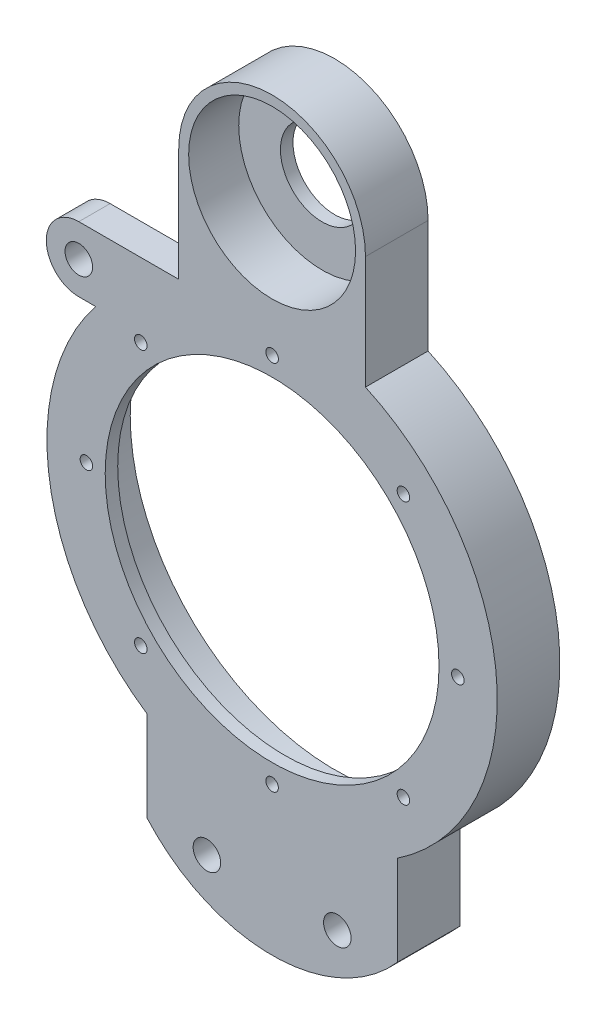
ISO-10303-21;
HEADER;
FILE_DESCRIPTION(('STEP AP214'),'2;1');
FILE_NAME('part.step','',(''),(''),'','','');
FILE_SCHEMA(('AUTOMOTIVE_DESIGN { 1 0 10303 214 1 1 1 1 }'));
ENDSEC;
DATA;
#1=APPLICATION_CONTEXT('core data for automotive mechanical design processes');
#2=APPLICATION_PROTOCOL_DEFINITION('international standard','automotive_design',2000,#1);
#3=PRODUCT_CONTEXT('',#1,'mechanical');
#4=PRODUCT('Part','Part','',(#3));
#5=PRODUCT_RELATED_PRODUCT_CATEGORY('part','',(#4));
#6=PRODUCT_DEFINITION_FORMATION('','',#4);
#7=PRODUCT_DEFINITION_CONTEXT('part definition',#1,'design');
#8=PRODUCT_DEFINITION('design','',#6,#7);
#9=PRODUCT_DEFINITION_SHAPE('','',#8);
#10=(LENGTH_UNIT() NAMED_UNIT(*) SI_UNIT(.MILLI.,.METRE.));
#11=(NAMED_UNIT(*) PLANE_ANGLE_UNIT() SI_UNIT($,.RADIAN.));
#12=(NAMED_UNIT(*) SI_UNIT($,.STERADIAN.) SOLID_ANGLE_UNIT());
#13=UNCERTAINTY_MEASURE_WITH_UNIT(LENGTH_MEASURE(1.E-05),#10,'distance_accuracy_value','');
#14=(GEOMETRIC_REPRESENTATION_CONTEXT(3) GLOBAL_UNCERTAINTY_ASSIGNED_CONTEXT((#13)) GLOBAL_UNIT_ASSIGNED_CONTEXT((#10,
#11,#12)) REPRESENTATION_CONTEXT('',''));
#15=CARTESIAN_POINT('',(0.,0.,0.));
#16=DIRECTION('',(0.,0.,1.));
#17=DIRECTION('',(1.,0.,0.));
#18=AXIS2_PLACEMENT_3D('',#15,#16,#17);
#19=CARTESIAN_POINT('',(30.005594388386,142.651168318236,0.));
#20=DIRECTION('',(0.,0.,-1.));
#21=DIRECTION('',(-1.,0.,0.));
#22=AXIS2_PLACEMENT_3D('',#19,#20,#21);
#23=PLANE('',#22);
#24=CARTESIAN_POINT('',(30.005594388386,142.651168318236,0.));
#25=DIRECTION('',(0.,0.,-1.));
#26=DIRECTION('',(-1.,0.,0.));
#27=AXIS2_PLACEMENT_3D('',#24,#25,#26);
#28=CIRCLE('',#27,10.);
#29=CARTESIAN_POINT('',(20.005594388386,142.651168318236,0.));
#30=VERTEX_POINT('',#29);
#31=EDGE_CURVE('E467',#30,#30,#28,.T.);
#32=ORIENTED_EDGE('',*,*,#31,.F.);
#33=EDGE_LOOP('',(#32));
#34=FACE_BOUND('',#33,.T.);
#35=CARTESIAN_POINT('',(14.380594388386,-0.536865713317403,0.));
#36=DIRECTION('',(0.,0.,1.));
#37=DIRECTION('',(1.,0.,0.));
#38=AXIS2_PLACEMENT_3D('',#35,#36,#37);
#39=CIRCLE('',#38,3.3);
#40=CARTESIAN_POINT('',(17.680594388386,-0.536865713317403,0.));
#41=VERTEX_POINT('',#40);
#42=EDGE_CURVE('E447',#41,#41,#39,.T.);
#43=ORIENTED_EDGE('',*,*,#42,.T.);
#44=EDGE_LOOP('',(#43));
#45=FACE_BOUND('',#44,.T.);
#46=CARTESIAN_POINT('',(45.630594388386,-0.536865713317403,0.));
#47=DIRECTION('',(0.,0.,-1.));
#48=DIRECTION('',(-1.,0.,0.));
#49=AXIS2_PLACEMENT_3D('',#46,#47,#48);
#50=CIRCLE('',#49,3.3);
#51=CARTESIAN_POINT('',(42.330594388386,-0.536865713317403,0.));
#52=VERTEX_POINT('',#51);
#53=EDGE_CURVE('E455',#52,#52,#50,.T.);
#54=ORIENTED_EDGE('',*,*,#53,.F.);
#55=EDGE_LOOP('',(#54));
#56=FACE_BOUND('',#55,.T.);
#57=CARTESIAN_POINT('',(30.005594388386,66.4511683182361,0.));
#58=DIRECTION('',(0.,0.,-1.));
#59=DIRECTION('',(-1.,0.,0.));
#60=AXIS2_PLACEMENT_3D('',#57,#58,#59);
#61=CIRCLE('',#60,49.);
#62=CARTESIAN_POINT('',(-18.994405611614,66.4511683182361,0.));
#63=VERTEX_POINT('',#62);
#64=EDGE_CURVE('E474',#63,#63,#61,.T.);
#65=ORIENTED_EDGE('',*,*,#64,.F.);
#66=EDGE_LOOP('',(#65));
#67=FACE_BOUND('',#66,.T.);
#68=CARTESIAN_POINT('',(30.005594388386,66.4511683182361,0.));
#69=DIRECTION('',(0.,0.,1.));
#70=DIRECTION('',(1.,0.,0.));
#71=AXIS2_PLACEMENT_3D('',#68,#69,#70);
#72=CIRCLE('',#71,53.958270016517);
#73=CARTESIAN_POINT('',(7.63007924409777,115.551384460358,0.));
#74=VERTEX_POINT('',#73);
#75=CARTESIAN_POINT('',(0.,21.6052185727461,0.));
#76=VERTEX_POINT('',#75);
#77=EDGE_CURVE('E351',#74,#76,#72,.T.);
#78=ORIENTED_EDGE('',*,*,#77,.F.);
#79=DIRECTION('',(0.,-1.,0.));
#80=VECTOR('',#79,1.);
#81=CARTESIAN_POINT('',(7.63007924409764,142.651168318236,0.));
#82=LINE('',#81,#80);
#83=CARTESIAN_POINT('',(7.63007924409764,142.651168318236,0.));
#84=VERTEX_POINT('',#83);
#85=EDGE_CURVE('E354',#84,#74,#82,.T.);
#86=ORIENTED_EDGE('',*,*,#85,.F.);
#87=CARTESIAN_POINT('',(30.005594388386,142.651168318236,0.));
#88=DIRECTION('',(0.,0.,-1.));
#89=DIRECTION('',(-1.,0.,0.));
#90=AXIS2_PLACEMENT_3D('',#87,#88,#89);
#91=CIRCLE('',#90,22.3755151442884);
#92=CARTESIAN_POINT('',(52.3811095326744,142.651168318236,0.));
#93=VERTEX_POINT('',#92);
#94=EDGE_CURVE('E329',#84,#93,#91,.T.);
#95=ORIENTED_EDGE('',*,*,#94,.T.);
#96=DIRECTION('',(0.,1.,0.));
#97=VECTOR('',#96,1.);
#98=CARTESIAN_POINT('',(52.3811095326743,115.551384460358,0.));
#99=LINE('',#98,#97);
#100=CARTESIAN_POINT('',(52.3811095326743,115.551384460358,0.));
#101=VERTEX_POINT('',#100);
#102=EDGE_CURVE('E333',#101,#93,#99,.T.);
#103=ORIENTED_EDGE('',*,*,#102,.F.);
#104=CARTESIAN_POINT('',(30.005594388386,66.4511683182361,0.));
#105=DIRECTION('',(0.,0.,1.));
#106=DIRECTION('',(1.,0.,0.));
#107=AXIS2_PLACEMENT_3D('',#104,#105,#106);
#108=CIRCLE('',#107,53.958270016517);
#109=CARTESIAN_POINT('',(60.011188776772,21.6052185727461,0.));
#110=VERTEX_POINT('',#109);
#111=EDGE_CURVE('E338',#110,#101,#108,.T.);
#112=ORIENTED_EDGE('',*,*,#111,.F.);
#113=DIRECTION('',(0.,1.,0.));
#114=VECTOR('',#113,1.);
#115=CARTESIAN_POINT('',(60.011188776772,0.,0.));
#116=LINE('',#115,#114);
#117=CARTESIAN_POINT('',(60.011188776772,0.,0.));
#118=VERTEX_POINT('',#117);
#119=EDGE_CURVE('E341',#118,#110,#116,.T.);
#120=ORIENTED_EDGE('',*,*,#119,.F.);
#121=CARTESIAN_POINT('',(30.005594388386,26.4511683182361,0.));
#122=DIRECTION('',(0.,0.,1.));
#123=DIRECTION('',(1.,0.,0.));
#124=AXIS2_PLACEMENT_3D('',#121,#122,#123);
#125=CIRCLE('',#124,40.);
#126=CARTESIAN_POINT('',(0.,0.,0.));
#127=VERTEX_POINT('',#126);
#128=EDGE_CURVE('E344',#127,#118,#125,.T.);
#129=ORIENTED_EDGE('',*,*,#128,.F.);
#130=DIRECTION('',(0.,1.,0.));
#131=VECTOR('',#130,1.);
#132=CARTESIAN_POINT('',(0.,0.,0.));
#133=LINE('',#132,#131);
#134=EDGE_CURVE('E347',#127,#76,#133,.T.);
#135=ORIENTED_EDGE('',*,*,#134,.T.);
#136=EDGE_LOOP('',(#78,#86,#95,#103,#112,#120,#129,#135));
#137=FACE_BOUND('',#136,.T.);
#138=ADVANCED_FACE('F205',(#34,#45,#56,#67,#137),#23,.T.);
#139=CARTESIAN_POINT('',(7.63007924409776,115.551384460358,15.));
#140=DIRECTION('',(0.,-1.,0.));
#141=DIRECTION('',(0.,0.,-1.));
#142=AXIS2_PLACEMENT_3D('',#139,#140,#141);
#143=PLANE('',#142);
#144=DIRECTION('',(1.,0.,0.));
#145=VECTOR('',#144,1.);
#146=CARTESIAN_POINT('',(30.005594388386,115.551384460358,7.5));
#147=LINE('',#146,#145);
#148=CARTESIAN_POINT('',(-16.3138964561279,115.551384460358,7.5));
#149=VERTEX_POINT('',#148);
#150=CARTESIAN_POINT('',(7.63007924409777,115.551384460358,7.5));
#151=VERTEX_POINT('',#150);
#152=EDGE_CURVE('E309',#149,#151,#147,.T.);
#153=ORIENTED_EDGE('',*,*,#152,.F.);
#154=DIRECTION('',(0.,0.,-1.));
#155=VECTOR('',#154,1.);
#156=CARTESIAN_POINT('',(-16.3138964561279,115.551384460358,15.));
#157=LINE('',#156,#155);
#158=CARTESIAN_POINT('',(-16.3138964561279,115.551384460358,15.));
#159=VERTEX_POINT('',#158);
#160=EDGE_CURVE('E305',#159,#149,#157,.T.);
#161=ORIENTED_EDGE('',*,*,#160,.F.);
#162=DIRECTION('',(-1.,0.,0.));
#163=VECTOR('',#162,1.);
#164=CARTESIAN_POINT('',(7.63007924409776,115.551384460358,15.));
#165=LINE('',#164,#163);
#166=CARTESIAN_POINT('',(7.63007924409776,115.551384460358,15.));
#167=VERTEX_POINT('',#166);
#168=EDGE_CURVE('E290',#167,#159,#165,.T.);
#169=ORIENTED_EDGE('',*,*,#168,.F.);
#170=DIRECTION('',(0.,0.,-1.));
#171=VECTOR('',#170,1.);
#172=CARTESIAN_POINT('',(7.63007924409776,115.551384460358,15.));
#173=LINE('',#172,#171);
#174=EDGE_CURVE('E216',#167,#151,#173,.T.);
#175=ORIENTED_EDGE('',*,*,#174,.T.);
#176=EDGE_LOOP('',(#153,#161,#169,#175));
#177=FACE_BOUND('',#176,.T.);
#178=ADVANCED_FACE('F306',(#177),#143,.F.);
#179=CARTESIAN_POINT('',(-16.3138964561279,107.7542090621,15.));
#180=DIRECTION('',(0.,0.,-1.));
#181=DIRECTION('',(-1.,0.,0.));
#182=AXIS2_PLACEMENT_3D('',#179,#180,#181);
#183=CYLINDRICAL_SURFACE('',#182,7.7971753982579);
#184=CARTESIAN_POINT('',(-16.3138964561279,107.7542090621,7.5));
#185=DIRECTION('',(0.,0.,-1.));
#186=DIRECTION('',(-1.,0.,0.));
#187=AXIS2_PLACEMENT_3D('',#184,#185,#186);
#188=CIRCLE('',#187,7.7971753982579);
#189=CARTESIAN_POINT('',(-16.3138964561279,99.9570336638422,7.5));
#190=VERTEX_POINT('',#189);
#191=EDGE_CURVE('E416',#190,#149,#188,.T.);
#192=ORIENTED_EDGE('',*,*,#191,.F.);
#193=DIRECTION('',(0.,0.,-1.));
#194=VECTOR('',#193,1.);
#195=CARTESIAN_POINT('',(-16.3138964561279,99.9570336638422,15.));
#196=LINE('',#195,#194);
#197=CARTESIAN_POINT('',(-16.3138964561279,99.9570336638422,15.));
#198=VERTEX_POINT('',#197);
#199=EDGE_CURVE('E313',#198,#190,#196,.T.);
#200=ORIENTED_EDGE('',*,*,#199,.F.);
#201=CARTESIAN_POINT('',(-16.3138964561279,107.7542090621,15.));
#202=DIRECTION('',(0.,0.,1.));
#203=DIRECTION('',(1.,0.,0.));
#204=AXIS2_PLACEMENT_3D('',#201,#202,#203);
#205=CIRCLE('',#204,7.7971753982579);
#206=EDGE_CURVE('E295',#159,#198,#205,.T.);
#207=ORIENTED_EDGE('',*,*,#206,.F.);
#208=ORIENTED_EDGE('',*,*,#160,.T.);
#209=EDGE_LOOP('',(#192,#200,#207,#208));
#210=FACE_BOUND('',#209,.T.);
#211=ADVANCED_FACE('F315',(#210),#183,.T.);
#212=CARTESIAN_POINT('',(-16.3138964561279,99.9570336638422,15.));
#213=DIRECTION('',(0.,1.,0.));
#214=DIRECTION('',(0.,0.,1.));
#215=AXIS2_PLACEMENT_3D('',#212,#213,#214);
#216=PLANE('',#215);
#217=DIRECTION('',(-1.,0.,0.));
#218=VECTOR('',#217,1.);
#219=CARTESIAN_POINT('',(30.0055943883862,99.9570336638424,7.5));
#220=LINE('',#219,#218);
#221=CARTESIAN_POINT('',(-12.2892266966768,99.9570336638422,7.5));
#222=VERTEX_POINT('',#221);
#223=EDGE_CURVE('E402',#222,#190,#220,.T.);
#224=ORIENTED_EDGE('',*,*,#223,.F.);
#225=DIRECTION('',(0.,0.,-1.));
#226=VECTOR('',#225,1.);
#227=CARTESIAN_POINT('',(-12.2892266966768,99.9570336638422,15.));
#228=LINE('',#227,#226);
#229=CARTESIAN_POINT('',(-12.2892266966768,99.9570336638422,15.));
#230=VERTEX_POINT('',#229);
#231=EDGE_CURVE('E362',#230,#222,#228,.T.);
#232=ORIENTED_EDGE('',*,*,#231,.F.);
#233=DIRECTION('',(1.,0.,0.));
#234=VECTOR('',#233,1.);
#235=CARTESIAN_POINT('',(-16.3138964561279,99.9570336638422,15.));
#236=LINE('',#235,#234);
#237=EDGE_CURVE('E319',#198,#230,#236,.T.);
#238=ORIENTED_EDGE('',*,*,#237,.F.);
#239=ORIENTED_EDGE('',*,*,#199,.T.);
#240=EDGE_LOOP('',(#224,#232,#238,#239));
#241=FACE_BOUND('',#240,.T.);
#242=ADVANCED_FACE('F413',(#241),#216,.F.);
#243=CARTESIAN_POINT('',(30.005594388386,66.4511683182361,15.));
#244=DIRECTION('',(0.,0.,-1.));
#245=DIRECTION('',(-1.,0.,0.));
#246=AXIS2_PLACEMENT_3D('',#243,#244,#245);
#247=CYLINDRICAL_SURFACE('',#246,40.);
#248=CARTESIAN_POINT('',(30.005594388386,66.4511683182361,15.));
#249=DIRECTION('',(0.,0.,1.));
#250=DIRECTION('',(1.,0.,0.));
#251=AXIS2_PLACEMENT_3D('',#248,#249,#250);
#252=CIRCLE('',#251,40.);
#253=CARTESIAN_POINT('',(70.005594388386,66.4511683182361,15.));
#254=VERTEX_POINT('',#253);
#255=EDGE_CURVE('E442',#254,#254,#252,.T.);
#256=ORIENTED_EDGE('',*,*,#255,.T.);
#257=EDGE_LOOP('',(#256));
#258=FACE_BOUND('',#257,.T.);
#259=CARTESIAN_POINT('',(30.005594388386,66.4511683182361,12.));
#260=DIRECTION('',(0.,0.,-1.));
#261=DIRECTION('',(-1.,0.,0.));
#262=AXIS2_PLACEMENT_3D('',#259,#260,#261);
#263=CIRCLE('',#262,40.);
#264=CARTESIAN_POINT('',(-9.99440561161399,66.4511683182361,12.));
#265=VERTEX_POINT('',#264);
#266=EDGE_CURVE('E209',#265,#265,#263,.T.);
#267=ORIENTED_EDGE('',*,*,#266,.T.);
#268=EDGE_LOOP('',(#267));
#269=FACE_BOUND('',#268,.T.);
#270=ADVANCED_FACE('F624',(#258,#269),#247,.F.);
#271=CARTESIAN_POINT('',(30.005594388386,142.651168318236,15.));
#272=DIRECTION('',(0.,0.,-1.));
#273=DIRECTION('',(-1.,0.,0.));
#274=AXIS2_PLACEMENT_3D('',#271,#272,#273);
#275=CYLINDRICAL_SURFACE('',#274,20.);
#276=CARTESIAN_POINT('',(30.005594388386,142.651168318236,15.));
#277=DIRECTION('',(0.,0.,1.));
#278=DIRECTION('',(1.,0.,0.));
#279=AXIS2_PLACEMENT_3D('',#276,#277,#278);
#280=CIRCLE('',#279,20.);
#281=CARTESIAN_POINT('',(50.005594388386,142.651168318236,15.));
#282=VERTEX_POINT('',#281);
#283=EDGE_CURVE('E334',#282,#282,#280,.T.);
#284=ORIENTED_EDGE('',*,*,#283,.T.);
#285=EDGE_LOOP('',(#284));
#286=FACE_BOUND('',#285,.T.);
#287=CARTESIAN_POINT('',(30.005594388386,142.651168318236,3.));
#288=DIRECTION('',(0.,0.,-1.));
#289=DIRECTION('',(-1.,0.,0.));
#290=AXIS2_PLACEMENT_3D('',#287,#288,#289);
#291=CIRCLE('',#290,20.);
#292=CARTESIAN_POINT('',(10.005594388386,142.651168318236,3.));
#293=VERTEX_POINT('',#292);
#294=EDGE_CURVE('E459',#293,#293,#291,.T.);
#295=ORIENTED_EDGE('',*,*,#294,.T.);
#296=EDGE_LOOP('',(#295));
#297=FACE_BOUND('',#296,.T.);
#298=ADVANCED_FACE('F565',(#286,#297),#275,.F.);
#299=CARTESIAN_POINT('',(30.005594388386,142.651168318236,15.));
#300=DIRECTION('',(0.,0.,-1.));
#301=DIRECTION('',(-1.,0.,0.));
#302=AXIS2_PLACEMENT_3D('',#299,#300,#301);
#303=PLANE('',#302);
#304=CARTESIAN_POINT('',(-16.3138964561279,107.7542090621,15.));
#305=DIRECTION('',(0.,0.,1.));
#306=DIRECTION('',(1.,0.,0.));
#307=AXIS2_PLACEMENT_3D('',#304,#305,#306);
#308=CIRCLE('',#307,3.3);
#309=CARTESIAN_POINT('',(-13.0138964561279,107.7542090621,15.));
#310=VERTEX_POINT('',#309);
#311=EDGE_CURVE('E555',#310,#310,#308,.T.);
#312=ORIENTED_EDGE('',*,*,#311,.F.);
#313=EDGE_LOOP('',(#312));
#314=FACE_BOUND('',#313,.T.);
#315=CARTESIAN_POINT('',(30.005594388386,110.951168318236,15.));
#316=DIRECTION('',(0.,0.,-1.));
#317=DIRECTION('',(-1.,0.,0.));
#318=AXIS2_PLACEMENT_3D('',#315,#316,#317);
#319=CIRCLE('',#318,1.5);
#320=CARTESIAN_POINT('',(28.505594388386,110.951168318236,15.));
#321=VERTEX_POINT('',#320);
#322=EDGE_CURVE('E516',#321,#321,#319,.T.);
#323=ORIENTED_EDGE('',*,*,#322,.T.);
#324=EDGE_LOOP('',(#323));
#325=FACE_BOUND('',#324,.T.);
#326=CARTESIAN_POINT('',(-1.46065737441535,97.9174200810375,15.));
#327=DIRECTION('',(0.,0.,-1.));
#328=DIRECTION('',(-1.,0.,0.));
#329=AXIS2_PLACEMENT_3D('',#326,#327,#328);
#330=CIRCLE('',#329,1.50000000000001);
#331=CARTESIAN_POINT('',(-2.96065737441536,97.9174200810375,15.));
#332=VERTEX_POINT('',#331);
#333=EDGE_CURVE('E508',#332,#332,#330,.T.);
#334=ORIENTED_EDGE('',*,*,#333,.T.);
#335=EDGE_LOOP('',(#334));
#336=FACE_BOUND('',#335,.T.);
#337=CARTESIAN_POINT('',(-14.494405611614,66.4511683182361,15.));
#338=DIRECTION('',(0.,0.,-1.));
#339=DIRECTION('',(-1.,0.,0.));
#340=AXIS2_PLACEMENT_3D('',#337,#338,#339);
#341=CIRCLE('',#340,1.5);
#342=CARTESIAN_POINT('',(-15.994405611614,66.4511683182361,15.));
#343=VERTEX_POINT('',#342);
#344=EDGE_CURVE('E500',#343,#343,#341,.T.);
#345=ORIENTED_EDGE('',*,*,#344,.T.);
#346=EDGE_LOOP('',(#345));
#347=FACE_BOUND('',#346,.T.);
#348=CARTESIAN_POINT('',(-1.46065737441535,34.9849165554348,15.));
#349=DIRECTION('',(0.,0.,-1.));
#350=DIRECTION('',(-1.,0.,0.));
#351=AXIS2_PLACEMENT_3D('',#348,#349,#350);
#352=CIRCLE('',#351,1.5);
#353=CARTESIAN_POINT('',(-2.96065737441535,34.9849165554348,15.));
#354=VERTEX_POINT('',#353);
#355=EDGE_CURVE('E491',#354,#354,#352,.T.);
#356=ORIENTED_EDGE('',*,*,#355,.T.);
#357=EDGE_LOOP('',(#356));
#358=FACE_BOUND('',#357,.T.);
#359=CARTESIAN_POINT('',(30.005594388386,21.9511683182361,15.));
#360=DIRECTION('',(0.,0.,-1.));
#361=DIRECTION('',(-1.,0.,0.));
#362=AXIS2_PLACEMENT_3D('',#359,#360,#361);
#363=CIRCLE('',#362,1.5);
#364=CARTESIAN_POINT('',(28.505594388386,21.9511683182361,15.));
#365=VERTEX_POINT('',#364);
#366=EDGE_CURVE('E539',#365,#365,#363,.T.);
#367=ORIENTED_EDGE('',*,*,#366,.T.);
#368=EDGE_LOOP('',(#367));
#369=FACE_BOUND('',#368,.T.);
#370=CARTESIAN_POINT('',(61.4718461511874,34.9849165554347,15.));
#371=DIRECTION('',(0.,0.,-1.));
#372=DIRECTION('',(-1.,0.,0.));
#373=AXIS2_PLACEMENT_3D('',#370,#371,#372);
#374=CIRCLE('',#373,1.5);
#375=CARTESIAN_POINT('',(59.9718461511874,34.9849165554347,15.));
#376=VERTEX_POINT('',#375);
#377=EDGE_CURVE('E531',#376,#376,#374,.T.);
#378=ORIENTED_EDGE('',*,*,#377,.T.);
#379=EDGE_LOOP('',(#378));
#380=FACE_BOUND('',#379,.T.);
#381=CARTESIAN_POINT('',(74.505594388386,66.4511683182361,15.));
#382=DIRECTION('',(0.,0.,-1.));
#383=DIRECTION('',(-1.,0.,0.));
#384=AXIS2_PLACEMENT_3D('',#381,#382,#383);
#385=CIRCLE('',#384,1.5);
#386=CARTESIAN_POINT('',(73.005594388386,66.4511683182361,15.));
#387=VERTEX_POINT('',#386);
#388=EDGE_CURVE('E523',#387,#387,#385,.T.);
#389=ORIENTED_EDGE('',*,*,#388,.T.);
#390=EDGE_LOOP('',(#389));
#391=FACE_BOUND('',#390,.T.);
#392=CARTESIAN_POINT('',(61.4718461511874,97.9174200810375,15.));
#393=DIRECTION('',(0.,0.,-1.));
#394=DIRECTION('',(-1.,0.,0.));
#395=AXIS2_PLACEMENT_3D('',#392,#393,#394);
#396=CIRCLE('',#395,1.50000000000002);
#397=CARTESIAN_POINT('',(59.9718461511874,97.9174200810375,15.));
#398=VERTEX_POINT('',#397);
#399=EDGE_CURVE('E479',#398,#398,#396,.T.);
#400=ORIENTED_EDGE('',*,*,#399,.T.);
#401=EDGE_LOOP('',(#400));
#402=FACE_BOUND('',#401,.T.);
#403=CARTESIAN_POINT('',(45.630594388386,-0.536865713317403,15.));
#404=DIRECTION('',(0.,0.,-1.));
#405=DIRECTION('',(-1.,0.,0.));
#406=AXIS2_PLACEMENT_3D('',#403,#404,#405);
#407=CIRCLE('',#406,3.3);
#408=CARTESIAN_POINT('',(42.330594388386,-0.536865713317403,15.));
#409=VERTEX_POINT('',#408);
#410=EDGE_CURVE('E451',#409,#409,#407,.T.);
#411=ORIENTED_EDGE('',*,*,#410,.T.);
#412=EDGE_LOOP('',(#411));
#413=FACE_BOUND('',#412,.T.);
#414=CARTESIAN_POINT('',(30.005594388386,142.651168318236,15.));
#415=DIRECTION('',(0.,0.,-1.));
#416=DIRECTION('',(-1.,0.,0.));
#417=AXIS2_PLACEMENT_3D('',#414,#415,#416);
#418=CIRCLE('',#417,22.3755151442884);
#419=CARTESIAN_POINT('',(7.63007924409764,142.651168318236,15.));
#420=VERTEX_POINT('',#419);
#421=CARTESIAN_POINT('',(52.3811095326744,142.651168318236,15.));
#422=VERTEX_POINT('',#421);
#423=EDGE_CURVE('E356',#420,#422,#418,.T.);
#424=ORIENTED_EDGE('',*,*,#423,.F.);
#425=DIRECTION('',(0.,-1.,0.));
#426=VECTOR('',#425,1.);
#427=CARTESIAN_POINT('',(7.63007924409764,142.651168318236,15.));
#428=LINE('',#427,#426);
#429=EDGE_CURVE('E297',#420,#167,#428,.T.);
#430=ORIENTED_EDGE('',*,*,#429,.T.);
#431=ORIENTED_EDGE('',*,*,#168,.T.);
#432=ORIENTED_EDGE('',*,*,#206,.T.);
#433=ORIENTED_EDGE('',*,*,#237,.T.);
#434=CARTESIAN_POINT('',(30.005594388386,66.4511683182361,15.));
#435=DIRECTION('',(0.,0.,1.));
#436=DIRECTION('',(1.,0.,0.));
#437=AXIS2_PLACEMENT_3D('',#434,#435,#436);
#438=CIRCLE('',#437,53.958270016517);
#439=CARTESIAN_POINT('',(0.,21.6052185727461,15.));
#440=VERTEX_POINT('',#439);
#441=EDGE_CURVE('E322',#230,#440,#438,.T.);
#442=ORIENTED_EDGE('',*,*,#441,.T.);
#443=DIRECTION('',(0.,1.,0.));
#444=VECTOR('',#443,1.);
#445=CARTESIAN_POINT('',(0.,0.,15.));
#446=LINE('',#445,#444);
#447=CARTESIAN_POINT('',(0.,0.,15.));
#448=VERTEX_POINT('',#447);
#449=EDGE_CURVE('E422',#448,#440,#446,.T.);
#450=ORIENTED_EDGE('',*,*,#449,.F.);
#451=CARTESIAN_POINT('',(30.005594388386,26.4511683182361,15.));
#452=DIRECTION('',(0.,0.,1.));
#453=DIRECTION('',(1.,0.,0.));
#454=AXIS2_PLACEMENT_3D('',#451,#452,#453);
#455=CIRCLE('',#454,40.);
#456=CARTESIAN_POINT('',(60.011188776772,0.,15.));
#457=VERTEX_POINT('',#456);
#458=EDGE_CURVE('E424',#448,#457,#455,.T.);
#459=ORIENTED_EDGE('',*,*,#458,.T.);
#460=DIRECTION('',(0.,1.,0.));
#461=VECTOR('',#460,1.);
#462=CARTESIAN_POINT('',(60.011188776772,0.,15.));
#463=LINE('',#462,#461);
#464=CARTESIAN_POINT('',(60.011188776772,21.6052185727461,15.));
#465=VERTEX_POINT('',#464);
#466=EDGE_CURVE('E429',#457,#465,#463,.T.);
#467=ORIENTED_EDGE('',*,*,#466,.T.);
#468=CARTESIAN_POINT('',(30.005594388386,66.4511683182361,15.));
#469=DIRECTION('',(0.,0.,1.));
#470=DIRECTION('',(1.,0.,0.));
#471=AXIS2_PLACEMENT_3D('',#468,#469,#470);
#472=CIRCLE('',#471,53.958270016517);
#473=CARTESIAN_POINT('',(52.3811095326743,115.551384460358,15.));
#474=VERTEX_POINT('',#473);
#475=EDGE_CURVE('E432',#465,#474,#472,.T.);
#476=ORIENTED_EDGE('',*,*,#475,.T.);
#477=DIRECTION('',(0.,1.,0.));
#478=VECTOR('',#477,1.);
#479=CARTESIAN_POINT('',(52.3811095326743,115.551384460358,15.));
#480=LINE('',#479,#478);
#481=EDGE_CURVE('E264',#474,#422,#480,.T.);
#482=ORIENTED_EDGE('',*,*,#481,.T.);
#483=EDGE_LOOP('',(#424,#430,#431,#432,#433,#442,#450,#459,#467,#476,#482));
#484=FACE_BOUND('',#483,.T.);
#485=ORIENTED_EDGE('',*,*,#283,.F.);
#486=EDGE_LOOP('',(#485));
#487=FACE_BOUND('',#486,.T.);
#488=ORIENTED_EDGE('',*,*,#255,.F.);
#489=EDGE_LOOP('',(#488));
#490=FACE_BOUND('',#489,.T.);
#491=CARTESIAN_POINT('',(14.380594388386,-0.536865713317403,15.));
#492=DIRECTION('',(0.,0.,1.));
#493=DIRECTION('',(1.,0.,0.));
#494=AXIS2_PLACEMENT_3D('',#491,#492,#493);
#495=CIRCLE('',#494,3.3);
#496=CARTESIAN_POINT('',(17.680594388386,-0.536865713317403,15.));
#497=VERTEX_POINT('',#496);
#498=EDGE_CURVE('E446',#497,#497,#495,.T.);
#499=ORIENTED_EDGE('',*,*,#498,.F.);
#500=EDGE_LOOP('',(#499));
#501=FACE_BOUND('',#500,.T.);
#502=ADVANCED_FACE('F292',(#314,#325,#336,#347,#358,#369,#380,#391,#402,#413,#484,#487,#490,
#501),#303,.F.);
#503=CARTESIAN_POINT('',(30.005594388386,142.651168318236,15.));
#504=DIRECTION('',(0.,0.,-1.));
#505=DIRECTION('',(-1.,0.,0.));
#506=AXIS2_PLACEMENT_3D('',#503,#504,#505);
#507=CYLINDRICAL_SURFACE('',#506,22.3755151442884);
#508=ORIENTED_EDGE('',*,*,#94,.F.);
#509=DIRECTION('',(0.,0.,-1.));
#510=VECTOR('',#509,1.);
#511=CARTESIAN_POINT('',(7.63007924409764,142.651168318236,15.));
#512=LINE('',#511,#510);
#513=EDGE_CURVE('E14',#420,#84,#512,.T.);
#514=ORIENTED_EDGE('',*,*,#513,.F.);
#515=ORIENTED_EDGE('',*,*,#423,.T.);
#516=DIRECTION('',(0.,0.,-1.));
#517=VECTOR('',#516,1.);
#518=CARTESIAN_POINT('',(52.3811095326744,142.651168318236,15.));
#519=LINE('',#518,#517);
#520=EDGE_CURVE('E328',#422,#93,#519,.T.);
#521=ORIENTED_EDGE('',*,*,#520,.T.);
#522=EDGE_LOOP('',(#508,#514,#515,#521));
#523=FACE_BOUND('',#522,.T.);
#524=ADVANCED_FACE('F207',(#523),#507,.T.);
#525=CARTESIAN_POINT('',(7.63007924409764,142.651168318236,15.));
#526=DIRECTION('',(1.,0.,0.));
#527=DIRECTION('',(0.,1.,0.));
#528=AXIS2_PLACEMENT_3D('',#525,#526,#527);
#529=PLANE('',#528);
#530=ORIENTED_EDGE('',*,*,#85,.T.);
#531=DIRECTION('',(0.,0.,-1.));
#532=VECTOR('',#531,1.);
#533=CARTESIAN_POINT('',(7.63007924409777,115.551384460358,7.5));
#534=LINE('',#533,#532);
#535=EDGE_CURVE('E394',#151,#74,#534,.T.);
#536=ORIENTED_EDGE('',*,*,#535,.F.);
#537=ORIENTED_EDGE('',*,*,#174,.F.);
#538=ORIENTED_EDGE('',*,*,#429,.F.);
#539=ORIENTED_EDGE('',*,*,#513,.T.);
#540=EDGE_LOOP('',(#530,#536,#537,#538,#539));
#541=FACE_BOUND('',#540,.T.);
#542=ADVANCED_FACE('F392',(#541),#529,.F.);
#543=CARTESIAN_POINT('',(30.005594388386,66.4511683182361,15.));
#544=DIRECTION('',(0.,0.,-1.));
#545=DIRECTION('',(-1.,0.,0.));
#546=AXIS2_PLACEMENT_3D('',#543,#544,#545);
#547=CYLINDRICAL_SURFACE('',#546,53.958270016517);
#548=ORIENTED_EDGE('',*,*,#77,.T.);
#549=DIRECTION('',(0.,0.,-1.));
#550=VECTOR('',#549,1.);
#551=CARTESIAN_POINT('',(0.,21.6052185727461,15.));
#552=LINE('',#551,#550);
#553=EDGE_CURVE('E251',#440,#76,#552,.T.);
#554=ORIENTED_EDGE('',*,*,#553,.F.);
#555=ORIENTED_EDGE('',*,*,#441,.F.);
#556=ORIENTED_EDGE('',*,*,#231,.T.);
#557=CARTESIAN_POINT('',(30.005594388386,66.4511683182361,7.5));
#558=DIRECTION('',(0.,0.,-1.));
#559=DIRECTION('',(-1.,0.,0.));
#560=AXIS2_PLACEMENT_3D('',#557,#558,#559);
#561=CIRCLE('',#560,53.958270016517);
#562=EDGE_CURVE('E406',#222,#151,#561,.T.);
#563=ORIENTED_EDGE('',*,*,#562,.T.);
#564=ORIENTED_EDGE('',*,*,#535,.T.);
#565=EDGE_LOOP('',(#548,#554,#555,#556,#563,#564));
#566=FACE_BOUND('',#565,.T.);
#567=ADVANCED_FACE('F419',(#566),#547,.T.);
#568=CARTESIAN_POINT('',(0.,0.,15.));
#569=DIRECTION('',(-1.,0.,0.));
#570=DIRECTION('',(0.,-1.,0.));
#571=AXIS2_PLACEMENT_3D('',#568,#569,#570);
#572=PLANE('',#571);
#573=ORIENTED_EDGE('',*,*,#134,.F.);
#574=DIRECTION('',(0.,0.,-1.));
#575=VECTOR('',#574,1.);
#576=CARTESIAN_POINT('',(0.,0.,15.));
#577=LINE('',#576,#575);
#578=EDGE_CURVE('E368',#448,#127,#577,.T.);
#579=ORIENTED_EDGE('',*,*,#578,.F.);
#580=ORIENTED_EDGE('',*,*,#449,.T.);
#581=ORIENTED_EDGE('',*,*,#553,.T.);
#582=EDGE_LOOP('',(#573,#579,#580,#581));
#583=FACE_BOUND('',#582,.T.);
#584=ADVANCED_FACE('F640',(#583),#572,.T.);
#585=CARTESIAN_POINT('',(30.005594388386,26.4511683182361,15.));
#586=DIRECTION('',(0.,0.,-1.));
#587=DIRECTION('',(-1.,0.,0.));
#588=AXIS2_PLACEMENT_3D('',#585,#586,#587);
#589=CYLINDRICAL_SURFACE('',#588,40.);
#590=ORIENTED_EDGE('',*,*,#128,.T.);
#591=DIRECTION('',(0.,0.,-1.));
#592=VECTOR('',#591,1.);
#593=CARTESIAN_POINT('',(60.011188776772,0.,15.));
#594=LINE('',#593,#592);
#595=EDGE_CURVE('E371',#457,#118,#594,.T.);
#596=ORIENTED_EDGE('',*,*,#595,.F.);
#597=ORIENTED_EDGE('',*,*,#458,.F.);
#598=ORIENTED_EDGE('',*,*,#578,.T.);
#599=EDGE_LOOP('',(#590,#596,#597,#598));
#600=FACE_BOUND('',#599,.T.);
#601=ADVANCED_FACE('F643',(#600),#589,.T.);
#602=CARTESIAN_POINT('',(60.011188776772,0.,15.));
#603=DIRECTION('',(-1.,0.,0.));
#604=DIRECTION('',(0.,0.,1.));
#605=AXIS2_PLACEMENT_3D('',#602,#603,#604);
#606=PLANE('',#605);
#607=ORIENTED_EDGE('',*,*,#119,.T.);
#608=DIRECTION('',(0.,0.,-1.));
#609=VECTOR('',#608,1.);
#610=CARTESIAN_POINT('',(60.011188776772,21.6052185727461,15.));
#611=LINE('',#610,#609);
#612=EDGE_CURVE('E375',#465,#110,#611,.T.);
#613=ORIENTED_EDGE('',*,*,#612,.F.);
#614=ORIENTED_EDGE('',*,*,#466,.F.);
#615=ORIENTED_EDGE('',*,*,#595,.T.);
#616=EDGE_LOOP('',(#607,#613,#614,#615));
#617=FACE_BOUND('',#616,.T.);
#618=ADVANCED_FACE('F646',(#617),#606,.F.);
#619=CARTESIAN_POINT('',(30.005594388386,66.4511683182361,15.));
#620=DIRECTION('',(0.,0.,-1.));
#621=DIRECTION('',(-1.,0.,0.));
#622=AXIS2_PLACEMENT_3D('',#619,#620,#621);
#623=CYLINDRICAL_SURFACE('',#622,53.958270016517);
#624=ORIENTED_EDGE('',*,*,#111,.T.);
#625=DIRECTION('',(0.,0.,-1.));
#626=VECTOR('',#625,1.);
#627=CARTESIAN_POINT('',(52.3811095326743,115.551384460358,15.));
#628=LINE('',#627,#626);
#629=EDGE_CURVE('E379',#474,#101,#628,.T.);
#630=ORIENTED_EDGE('',*,*,#629,.F.);
#631=ORIENTED_EDGE('',*,*,#475,.F.);
#632=ORIENTED_EDGE('',*,*,#612,.T.);
#633=EDGE_LOOP('',(#624,#630,#631,#632));
#634=FACE_BOUND('',#633,.T.);
#635=ADVANCED_FACE('F650',(#634),#623,.T.);
#636=CARTESIAN_POINT('',(52.3811095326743,115.551384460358,15.));
#637=DIRECTION('',(-1.,0.,0.));
#638=DIRECTION('',(0.,-1.,0.));
#639=AXIS2_PLACEMENT_3D('',#636,#637,#638);
#640=PLANE('',#639);
#641=ORIENTED_EDGE('',*,*,#102,.T.);
#642=ORIENTED_EDGE('',*,*,#520,.F.);
#643=ORIENTED_EDGE('',*,*,#481,.F.);
#644=ORIENTED_EDGE('',*,*,#629,.T.);
#645=EDGE_LOOP('',(#641,#642,#643,#644));
#646=FACE_BOUND('',#645,.T.);
#647=ADVANCED_FACE('F385',(#646),#640,.F.);
#648=CARTESIAN_POINT('',(14.380594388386,-0.536865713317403,15.));
#649=DIRECTION('',(0.,0.,-1.));
#650=DIRECTION('',(-1.,0.,0.));
#651=AXIS2_PLACEMENT_3D('',#648,#649,#650);
#652=CYLINDRICAL_SURFACE('',#651,3.3);
#653=ORIENTED_EDGE('',*,*,#498,.T.);
#654=EDGE_LOOP('',(#653));
#655=FACE_BOUND('',#654,.T.);
#656=ORIENTED_EDGE('',*,*,#42,.F.);
#657=EDGE_LOOP('',(#656));
#658=FACE_BOUND('',#657,.T.);
#659=ADVANCED_FACE('F589',(#655,#658),#652,.F.);
#660=CARTESIAN_POINT('',(45.630594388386,-0.536865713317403,15.));
#661=DIRECTION('',(0.,0.,-1.));
#662=DIRECTION('',(-1.,0.,0.));
#663=AXIS2_PLACEMENT_3D('',#660,#661,#662);
#664=CYLINDRICAL_SURFACE('',#663,3.3);
#665=ORIENTED_EDGE('',*,*,#410,.F.);
#666=EDGE_LOOP('',(#665));
#667=FACE_BOUND('',#666,.T.);
#668=ORIENTED_EDGE('',*,*,#53,.T.);
#669=EDGE_LOOP('',(#668));
#670=FACE_BOUND('',#669,.T.);
#671=ADVANCED_FACE('F585',(#667,#670),#664,.F.);
#672=CARTESIAN_POINT('',(30.005594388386,142.651168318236,3.));
#673=DIRECTION('',(0.,0.,-1.));
#674=DIRECTION('',(-1.,0.,0.));
#675=AXIS2_PLACEMENT_3D('',#672,#673,#674);
#676=PLANE('',#675);
#677=CARTESIAN_POINT('',(30.005594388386,142.651168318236,3.));
#678=DIRECTION('',(0.,0.,-1.));
#679=DIRECTION('',(-1.,0.,0.));
#680=AXIS2_PLACEMENT_3D('',#677,#678,#679);
#681=CIRCLE('',#680,10.);
#682=CARTESIAN_POINT('',(20.005594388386,142.651168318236,3.));
#683=VERTEX_POINT('',#682);
#684=EDGE_CURVE('E466',#683,#683,#681,.T.);
#685=ORIENTED_EDGE('',*,*,#684,.T.);
#686=EDGE_LOOP('',(#685));
#687=FACE_BOUND('',#686,.T.);
#688=ORIENTED_EDGE('',*,*,#294,.F.);
#689=EDGE_LOOP('',(#688));
#690=FACE_BOUND('',#689,.T.);
#691=ADVANCED_FACE('F588',(#687,#690),#676,.F.);
#692=CARTESIAN_POINT('',(30.005594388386,142.651168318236,3.));
#693=DIRECTION('',(0.,0.,-1.));
#694=DIRECTION('',(-1.,0.,0.));
#695=AXIS2_PLACEMENT_3D('',#692,#693,#694);
#696=CYLINDRICAL_SURFACE('',#695,10.);
#697=ORIENTED_EDGE('',*,*,#684,.F.);
#698=EDGE_LOOP('',(#697));
#699=FACE_BOUND('',#698,.T.);
#700=ORIENTED_EDGE('',*,*,#31,.T.);
#701=EDGE_LOOP('',(#700));
#702=FACE_BOUND('',#701,.T.);
#703=ADVANCED_FACE('F602',(#699,#702),#696,.F.);
#704=CARTESIAN_POINT('',(30.005594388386,66.4511683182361,12.));
#705=DIRECTION('',(0.,0.,-1.));
#706=DIRECTION('',(-1.,0.,0.));
#707=AXIS2_PLACEMENT_3D('',#704,#705,#706);
#708=CYLINDRICAL_SURFACE('',#707,49.);
#709=CARTESIAN_POINT('',(30.005594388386,66.4511683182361,12.));
#710=DIRECTION('',(0.,0.,-1.));
#711=DIRECTION('',(-1.,0.,0.));
#712=AXIS2_PLACEMENT_3D('',#709,#710,#711);
#713=CIRCLE('',#712,49.);
#714=CARTESIAN_POINT('',(-18.994405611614,66.4511683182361,12.));
#715=VERTEX_POINT('',#714);
#716=EDGE_CURVE('E478',#715,#715,#713,.T.);
#717=ORIENTED_EDGE('',*,*,#716,.F.);
#718=EDGE_LOOP('',(#717));
#719=FACE_BOUND('',#718,.T.);
#720=ORIENTED_EDGE('',*,*,#64,.T.);
#721=EDGE_LOOP('',(#720));
#722=FACE_BOUND('',#721,.T.);
#723=ADVANCED_FACE('F599',(#719,#722),#708,.F.);
#724=CARTESIAN_POINT('',(30.005594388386,66.4511683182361,12.));
#725=DIRECTION('',(0.,0.,-1.));
#726=DIRECTION('',(-1.,0.,0.));
#727=AXIS2_PLACEMENT_3D('',#724,#725,#726);
#728=PLANE('',#727);
#729=CARTESIAN_POINT('',(30.005594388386,110.951168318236,12.));
#730=DIRECTION('',(0.,0.,-1.));
#731=DIRECTION('',(-1.,0.,0.));
#732=AXIS2_PLACEMENT_3D('',#729,#730,#731);
#733=CIRCLE('',#732,1.5);
#734=CARTESIAN_POINT('',(28.505594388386,110.951168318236,12.));
#735=VERTEX_POINT('',#734);
#736=EDGE_CURVE('E487',#735,#735,#733,.T.);
#737=ORIENTED_EDGE('',*,*,#736,.F.);
#738=EDGE_LOOP('',(#737));
#739=FACE_BOUND('',#738,.T.);
#740=CARTESIAN_POINT('',(-1.46065737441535,97.9174200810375,12.));
#741=DIRECTION('',(0.,0.,-1.));
#742=DIRECTION('',(-1.,0.,0.));
#743=AXIS2_PLACEMENT_3D('',#740,#741,#742);
#744=CIRCLE('',#743,1.50000000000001);
#745=CARTESIAN_POINT('',(-2.96065737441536,97.9174200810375,12.));
#746=VERTEX_POINT('',#745);
#747=EDGE_CURVE('E512',#746,#746,#744,.T.);
#748=ORIENTED_EDGE('',*,*,#747,.F.);
#749=EDGE_LOOP('',(#748));
#750=FACE_BOUND('',#749,.T.);
#751=CARTESIAN_POINT('',(-14.494405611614,66.4511683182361,12.));
#752=DIRECTION('',(0.,0.,-1.));
#753=DIRECTION('',(-1.,0.,0.));
#754=AXIS2_PLACEMENT_3D('',#751,#752,#753);
#755=CIRCLE('',#754,1.5);
#756=CARTESIAN_POINT('',(-15.994405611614,66.4511683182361,12.));
#757=VERTEX_POINT('',#756);
#758=EDGE_CURVE('E504',#757,#757,#755,.T.);
#759=ORIENTED_EDGE('',*,*,#758,.F.);
#760=EDGE_LOOP('',(#759));
#761=FACE_BOUND('',#760,.T.);
#762=CARTESIAN_POINT('',(-1.46065737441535,34.9849165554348,12.));
#763=DIRECTION('',(0.,0.,-1.));
#764=DIRECTION('',(-1.,0.,0.));
#765=AXIS2_PLACEMENT_3D('',#762,#763,#764);
#766=CIRCLE('',#765,1.5);
#767=CARTESIAN_POINT('',(-2.96065737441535,34.9849165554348,12.));
#768=VERTEX_POINT('',#767);
#769=EDGE_CURVE('E495',#768,#768,#766,.T.);
#770=ORIENTED_EDGE('',*,*,#769,.F.);
#771=EDGE_LOOP('',(#770));
#772=FACE_BOUND('',#771,.T.);
#773=CARTESIAN_POINT('',(30.005594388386,21.9511683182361,12.));
#774=DIRECTION('',(0.,0.,-1.));
#775=DIRECTION('',(-1.,0.,0.));
#776=AXIS2_PLACEMENT_3D('',#773,#774,#775);
#777=CIRCLE('',#776,1.5);
#778=CARTESIAN_POINT('',(28.505594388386,21.9511683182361,12.));
#779=VERTEX_POINT('',#778);
#780=EDGE_CURVE('E496',#779,#779,#777,.T.);
#781=ORIENTED_EDGE('',*,*,#780,.F.);
#782=EDGE_LOOP('',(#781));
#783=FACE_BOUND('',#782,.T.);
#784=CARTESIAN_POINT('',(61.4718461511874,34.9849165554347,12.));
#785=DIRECTION('',(0.,0.,-1.));
#786=DIRECTION('',(-1.,0.,0.));
#787=AXIS2_PLACEMENT_3D('',#784,#785,#786);
#788=CIRCLE('',#787,1.5);
#789=CARTESIAN_POINT('',(59.9718461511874,34.9849165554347,12.));
#790=VERTEX_POINT('',#789);
#791=EDGE_CURVE('E535',#790,#790,#788,.T.);
#792=ORIENTED_EDGE('',*,*,#791,.F.);
#793=EDGE_LOOP('',(#792));
#794=FACE_BOUND('',#793,.T.);
#795=CARTESIAN_POINT('',(74.505594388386,66.4511683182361,12.));
#796=DIRECTION('',(0.,0.,-1.));
#797=DIRECTION('',(-1.,0.,0.));
#798=AXIS2_PLACEMENT_3D('',#795,#796,#797);
#799=CIRCLE('',#798,1.5);
#800=CARTESIAN_POINT('',(73.005594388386,66.4511683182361,12.));
#801=VERTEX_POINT('',#800);
#802=EDGE_CURVE('E527',#801,#801,#799,.T.);
#803=ORIENTED_EDGE('',*,*,#802,.F.);
#804=EDGE_LOOP('',(#803));
#805=FACE_BOUND('',#804,.T.);
#806=CARTESIAN_POINT('',(61.4718461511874,97.9174200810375,12.));
#807=DIRECTION('',(0.,0.,-1.));
#808=DIRECTION('',(-1.,0.,0.));
#809=AXIS2_PLACEMENT_3D('',#806,#807,#808);
#810=CIRCLE('',#809,1.50000000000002);
#811=CARTESIAN_POINT('',(59.9718461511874,97.9174200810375,12.));
#812=VERTEX_POINT('',#811);
#813=EDGE_CURVE('E483',#812,#812,#810,.T.);
#814=ORIENTED_EDGE('',*,*,#813,.F.);
#815=EDGE_LOOP('',(#814));
#816=FACE_BOUND('',#815,.T.);
#817=ORIENTED_EDGE('',*,*,#266,.F.);
#818=EDGE_LOOP('',(#817));
#819=FACE_BOUND('',#818,.T.);
#820=ORIENTED_EDGE('',*,*,#716,.T.);
#821=EDGE_LOOP('',(#820));
#822=FACE_BOUND('',#821,.T.);
#823=ADVANCED_FACE('F601',(#739,#750,#761,#772,#783,#794,#805,#816,#819,#822),#728,.T.);
#824=CARTESIAN_POINT('',(61.4718461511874,97.9174200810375,15.));
#825=DIRECTION('',(0.,0.,-1.));
#826=DIRECTION('',(-1.,0.,0.));
#827=AXIS2_PLACEMENT_3D('',#824,#825,#826);
#828=CYLINDRICAL_SURFACE('',#827,1.50000000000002);
#829=ORIENTED_EDGE('',*,*,#399,.F.);
#830=EDGE_LOOP('',(#829));
#831=FACE_BOUND('',#830,.T.);
#832=ORIENTED_EDGE('',*,*,#813,.T.);
#833=EDGE_LOOP('',(#832));
#834=FACE_BOUND('',#833,.T.);
#835=ADVANCED_FACE('F609',(#831,#834),#828,.F.);
#836=CARTESIAN_POINT('',(74.505594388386,66.4511683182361,15.));
#837=DIRECTION('',(0.,0.,-1.));
#838=DIRECTION('',(-1.,0.,0.));
#839=AXIS2_PLACEMENT_3D('',#836,#837,#838);
#840=CYLINDRICAL_SURFACE('',#839,1.5);
#841=ORIENTED_EDGE('',*,*,#388,.F.);
#842=EDGE_LOOP('',(#841));
#843=FACE_BOUND('',#842,.T.);
#844=ORIENTED_EDGE('',*,*,#802,.T.);
#845=EDGE_LOOP('',(#844));
#846=FACE_BOUND('',#845,.T.);
#847=ADVANCED_FACE('F707',(#843,#846),#840,.F.);
#848=CARTESIAN_POINT('',(61.4718461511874,34.9849165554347,15.));
#849=DIRECTION('',(0.,0.,-1.));
#850=DIRECTION('',(-1.,0.,0.));
#851=AXIS2_PLACEMENT_3D('',#848,#849,#850);
#852=CYLINDRICAL_SURFACE('',#851,1.5);
#853=ORIENTED_EDGE('',*,*,#377,.F.);
#854=EDGE_LOOP('',(#853));
#855=FACE_BOUND('',#854,.T.);
#856=ORIENTED_EDGE('',*,*,#791,.T.);
#857=EDGE_LOOP('',(#856));
#858=FACE_BOUND('',#857,.T.);
#859=ADVANCED_FACE('F715',(#855,#858),#852,.F.);
#860=CARTESIAN_POINT('',(30.005594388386,21.9511683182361,15.));
#861=DIRECTION('',(0.,0.,-1.));
#862=DIRECTION('',(-1.,0.,0.));
#863=AXIS2_PLACEMENT_3D('',#860,#861,#862);
#864=CYLINDRICAL_SURFACE('',#863,1.5);
#865=ORIENTED_EDGE('',*,*,#366,.F.);
#866=EDGE_LOOP('',(#865));
#867=FACE_BOUND('',#866,.T.);
#868=ORIENTED_EDGE('',*,*,#780,.T.);
#869=EDGE_LOOP('',(#868));
#870=FACE_BOUND('',#869,.T.);
#871=ADVANCED_FACE('F724',(#867,#870),#864,.F.);
#872=CARTESIAN_POINT('',(-1.46065737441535,34.9849165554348,15.));
#873=DIRECTION('',(0.,0.,-1.));
#874=DIRECTION('',(-1.,0.,0.));
#875=AXIS2_PLACEMENT_3D('',#872,#873,#874);
#876=CYLINDRICAL_SURFACE('',#875,1.5);
#877=ORIENTED_EDGE('',*,*,#355,.F.);
#878=EDGE_LOOP('',(#877));
#879=FACE_BOUND('',#878,.T.);
#880=ORIENTED_EDGE('',*,*,#769,.T.);
#881=EDGE_LOOP('',(#880));
#882=FACE_BOUND('',#881,.T.);
#883=ADVANCED_FACE('F733',(#879,#882),#876,.F.);
#884=CARTESIAN_POINT('',(-14.494405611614,66.4511683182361,15.));
#885=DIRECTION('',(0.,0.,-1.));
#886=DIRECTION('',(-1.,0.,0.));
#887=AXIS2_PLACEMENT_3D('',#884,#885,#886);
#888=CYLINDRICAL_SURFACE('',#887,1.5);
#889=ORIENTED_EDGE('',*,*,#344,.F.);
#890=EDGE_LOOP('',(#889));
#891=FACE_BOUND('',#890,.T.);
#892=ORIENTED_EDGE('',*,*,#758,.T.);
#893=EDGE_LOOP('',(#892));
#894=FACE_BOUND('',#893,.T.);
#895=ADVANCED_FACE('F742',(#891,#894),#888,.F.);
#896=CARTESIAN_POINT('',(-1.46065737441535,97.9174200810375,15.));
#897=DIRECTION('',(0.,0.,-1.));
#898=DIRECTION('',(-1.,0.,0.));
#899=AXIS2_PLACEMENT_3D('',#896,#897,#898);
#900=CYLINDRICAL_SURFACE('',#899,1.50000000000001);
#901=ORIENTED_EDGE('',*,*,#333,.F.);
#902=EDGE_LOOP('',(#901));
#903=FACE_BOUND('',#902,.T.);
#904=ORIENTED_EDGE('',*,*,#747,.T.);
#905=EDGE_LOOP('',(#904));
#906=FACE_BOUND('',#905,.T.);
#907=ADVANCED_FACE('F751',(#903,#906),#900,.F.);
#908=CARTESIAN_POINT('',(30.005594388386,110.951168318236,15.));
#909=DIRECTION('',(0.,0.,-1.));
#910=DIRECTION('',(-1.,0.,0.));
#911=AXIS2_PLACEMENT_3D('',#908,#909,#910);
#912=CYLINDRICAL_SURFACE('',#911,1.5);
#913=ORIENTED_EDGE('',*,*,#322,.F.);
#914=EDGE_LOOP('',(#913));
#915=FACE_BOUND('',#914,.T.);
#916=ORIENTED_EDGE('',*,*,#736,.T.);
#917=EDGE_LOOP('',(#916));
#918=FACE_BOUND('',#917,.T.);
#919=ADVANCED_FACE('F760',(#915,#918),#912,.F.);
#920=CARTESIAN_POINT('',(-16.3138964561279,107.7542090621,7.5));
#921=DIRECTION('',(0.,0.,-1.));
#922=DIRECTION('',(-1.,0.,0.));
#923=AXIS2_PLACEMENT_3D('',#920,#921,#922);
#924=PLANE('',#923);
#925=CARTESIAN_POINT('',(-16.3138964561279,107.7542090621,7.5));
#926=DIRECTION('',(0.,0.,-1.));
#927=DIRECTION('',(-1.,0.,0.));
#928=AXIS2_PLACEMENT_3D('',#925,#926,#927);
#929=CIRCLE('',#928,3.3);
#930=CARTESIAN_POINT('',(-19.6138964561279,107.7542090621,7.5));
#931=VERTEX_POINT('',#930);
#932=EDGE_CURVE('E417',#931,#931,#929,.T.);
#933=ORIENTED_EDGE('',*,*,#932,.F.);
#934=EDGE_LOOP('',(#933));
#935=FACE_BOUND('',#934,.T.);
#936=ORIENTED_EDGE('',*,*,#223,.T.);
#937=ORIENTED_EDGE('',*,*,#191,.T.);
#938=ORIENTED_EDGE('',*,*,#152,.T.);
#939=ORIENTED_EDGE('',*,*,#562,.F.);
#940=EDGE_LOOP('',(#936,#937,#938,#939));
#941=FACE_BOUND('',#940,.T.);
#942=ADVANCED_FACE('F407',(#935,#941),#924,.T.);
#943=CARTESIAN_POINT('',(-16.3138964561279,107.7542090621,0.));
#944=DIRECTION('',(0.,0.,1.));
#945=DIRECTION('',(1.,0.,0.));
#946=AXIS2_PLACEMENT_3D('',#943,#944,#945);
#947=CYLINDRICAL_SURFACE('',#946,3.3);
#948=ORIENTED_EDGE('',*,*,#932,.T.);
#949=EDGE_LOOP('',(#948));
#950=FACE_BOUND('',#949,.T.);
#951=ORIENTED_EDGE('',*,*,#311,.T.);
#952=EDGE_LOOP('',(#951));
#953=FACE_BOUND('',#952,.T.);
#954=ADVANCED_FACE('F561',(#950,#953),#947,.F.);
#955=CLOSED_SHELL('',(#138,#178,#211,#242,#270,#298,#502,#524,#542,#567,#584,#601,#618,#635,
#647,#659,#671,#691,#703,#723,#823,#835,#847,#859,#871,#883,#895,#907,#919,#942,#954));
#956=MANIFOLD_SOLID_BREP('B2',#955);
#957=ADVANCED_BREP_SHAPE_REPRESENTATION('',(#18,#956),#14);
#958=SHAPE_DEFINITION_REPRESENTATION(#9,#957);
ENDSEC;
END-ISO-10303-21;
